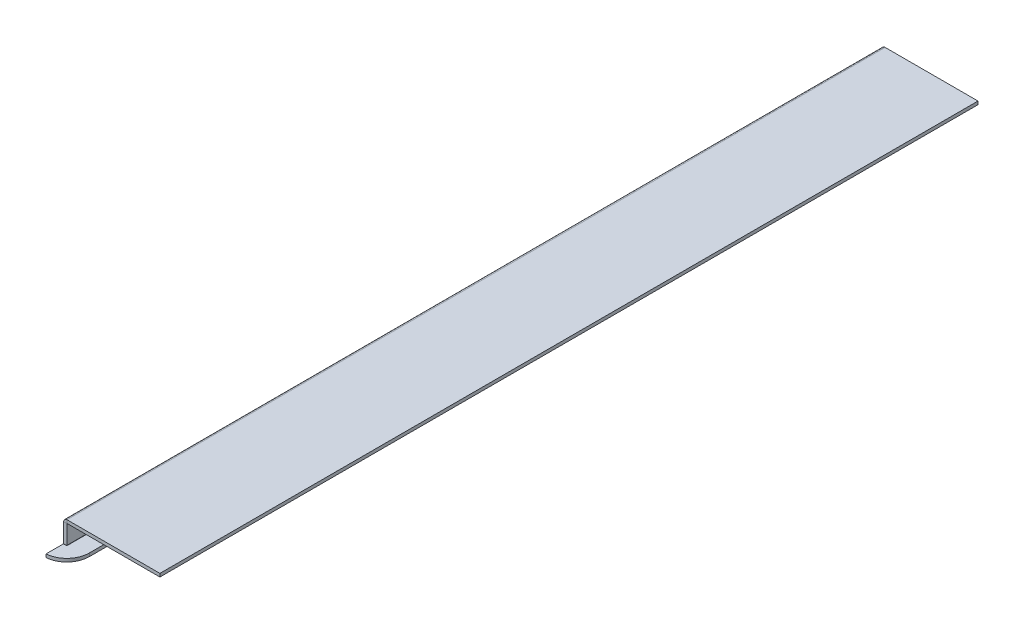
ISO-10303-21;
HEADER;
FILE_DESCRIPTION(('STEP AP214'),'2;1');
FILE_NAME('part.step','',(''),(''),'','','');
FILE_SCHEMA(('AUTOMOTIVE_DESIGN { 1 0 10303 214 1 1 1 1 }'));
ENDSEC;
DATA;
#1=APPLICATION_CONTEXT('core data for automotive mechanical design processes');
#2=APPLICATION_PROTOCOL_DEFINITION('international standard','automotive_design',2000,#1);
#3=PRODUCT_CONTEXT('',#1,'mechanical');
#4=PRODUCT('Part','Part','',(#3));
#5=PRODUCT_RELATED_PRODUCT_CATEGORY('part','',(#4));
#6=PRODUCT_DEFINITION_FORMATION('','',#4);
#7=PRODUCT_DEFINITION_CONTEXT('part definition',#1,'design');
#8=PRODUCT_DEFINITION('design','',#6,#7);
#9=PRODUCT_DEFINITION_SHAPE('','',#8);
#10=(LENGTH_UNIT() NAMED_UNIT(*) SI_UNIT(.MILLI.,.METRE.));
#11=(NAMED_UNIT(*) PLANE_ANGLE_UNIT() SI_UNIT($,.RADIAN.));
#12=(NAMED_UNIT(*) SI_UNIT($,.STERADIAN.) SOLID_ANGLE_UNIT());
#13=UNCERTAINTY_MEASURE_WITH_UNIT(LENGTH_MEASURE(1.E-05),#10,'distance_accuracy_value','');
#14=(GEOMETRIC_REPRESENTATION_CONTEXT(3) GLOBAL_UNCERTAINTY_ASSIGNED_CONTEXT((#13)) GLOBAL_UNIT_ASSIGNED_CONTEXT((#10,
#11,#12)) REPRESENTATION_CONTEXT('',''));
#15=CARTESIAN_POINT('',(0.,0.,0.));
#16=DIRECTION('',(0.,0.,1.));
#17=DIRECTION('',(1.,0.,0.));
#18=AXIS2_PLACEMENT_3D('',#15,#16,#17);
#19=CARTESIAN_POINT('',(0.,0.,255.));
#20=DIRECTION('',(0.,1.,0.));
#21=DIRECTION('',(-1.,0.,0.));
#22=AXIS2_PLACEMENT_3D('',#19,#20,#21);
#23=PLANE('',#22);
#24=CARTESIAN_POINT('',(-0.999999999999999,0.,-252.035759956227));
#25=DIRECTION('',(0.,1.,0.));
#26=DIRECTION('',(-1.,0.,0.));
#27=AXIS2_PLACEMENT_3D('',#24,#25,#26);
#28=CIRCLE('',#27,14.);
#29=CARTESIAN_POINT('',(-7.33198224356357E-11,0.,-266.000000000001));
#30=VERTEX_POINT('',#29);
#31=CARTESIAN_POINT('',(13.,0.,-252.035759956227));
#32=VERTEX_POINT('',#31);
#33=EDGE_CURVE('E323',#30,#32,#28,.F.);
#34=ORIENTED_EDGE('',*,*,#33,.T.);
#35=DIRECTION('',(0.,0.,-1.));
#36=VECTOR('',#35,1.);
#37=CARTESIAN_POINT('',(13.,0.,255.));
#38=LINE('',#37,#36);
#39=CARTESIAN_POINT('',(13.,0.,252.035759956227));
#40=VERTEX_POINT('',#39);
#41=EDGE_CURVE('E209',#40,#32,#38,.T.);
#42=ORIENTED_EDGE('',*,*,#41,.F.);
#43=CARTESIAN_POINT('',(-0.999999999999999,0.,252.035759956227));
#44=DIRECTION('',(0.,1.,0.));
#45=DIRECTION('',(-1.,0.,0.));
#46=AXIS2_PLACEMENT_3D('',#43,#44,#45);
#47=CIRCLE('',#46,14.);
#48=CARTESIAN_POINT('',(-7.33198224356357E-11,0.,266.000000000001));
#49=VERTEX_POINT('',#48);
#50=EDGE_CURVE('E319',#49,#40,#47,.T.);
#51=ORIENTED_EDGE('',*,*,#50,.F.);
#52=DIRECTION('',(0.,0.,-1.));
#53=VECTOR('',#52,1.);
#54=CARTESIAN_POINT('',(-7.33193887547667E-11,0.,255.1));
#55=LINE('',#54,#53);
#56=CARTESIAN_POINT('',(-7.33193887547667E-11,0.,255.1));
#57=VERTEX_POINT('',#56);
#58=EDGE_CURVE('E373',#49,#57,#55,.T.);
#59=ORIENTED_EDGE('',*,*,#58,.T.);
#60=DIRECTION('',(1.,0.,0.));
#61=VECTOR('',#60,1.);
#62=CARTESIAN_POINT('',(2.1,0.,255.1));
#63=LINE('',#62,#61);
#64=CARTESIAN_POINT('',(2.1,0.,255.1));
#65=VERTEX_POINT('',#64);
#66=EDGE_CURVE('E363',#57,#65,#63,.T.);
#67=ORIENTED_EDGE('',*,*,#66,.T.);
#68=DIRECTION('',(0.,0.,-1.));
#69=VECTOR('',#68,1.);
#70=CARTESIAN_POINT('',(2.1,0.,255.));
#71=LINE('',#70,#69);
#72=CARTESIAN_POINT('',(2.1,0.,255.));
#73=VERTEX_POINT('',#72);
#74=EDGE_CURVE('E372',#65,#73,#71,.T.);
#75=ORIENTED_EDGE('',*,*,#74,.T.);
#76=DIRECTION('',(0.,0.,-1.));
#77=VECTOR('',#76,1.);
#78=CARTESIAN_POINT('',(2.1,0.,255.));
#79=LINE('',#78,#77);
#80=CARTESIAN_POINT('',(2.1,0.,-255.));
#81=VERTEX_POINT('',#80);
#82=EDGE_CURVE('E160',#73,#81,#79,.T.);
#83=ORIENTED_EDGE('',*,*,#82,.T.);
#84=DIRECTION('',(0.,0.,1.));
#85=VECTOR('',#84,1.);
#86=CARTESIAN_POINT('',(2.1,0.,-255.));
#87=LINE('',#86,#85);
#88=CARTESIAN_POINT('',(2.1,0.,-255.1));
#89=VERTEX_POINT('',#88);
#90=EDGE_CURVE('E417',#89,#81,#87,.T.);
#91=ORIENTED_EDGE('',*,*,#90,.F.);
#92=DIRECTION('',(1.,0.,0.));
#93=VECTOR('',#92,1.);
#94=CARTESIAN_POINT('',(2.1,0.,-255.1));
#95=LINE('',#94,#93);
#96=CARTESIAN_POINT('',(-7.33193887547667E-11,0.,-255.1));
#97=VERTEX_POINT('',#96);
#98=EDGE_CURVE('E418',#97,#89,#95,.T.);
#99=ORIENTED_EDGE('',*,*,#98,.F.);
#100=DIRECTION('',(0.,0.,1.));
#101=VECTOR('',#100,1.);
#102=CARTESIAN_POINT('',(-7.33193887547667E-11,0.,-255.1));
#103=LINE('',#102,#101);
#104=EDGE_CURVE('E399',#30,#97,#103,.T.);
#105=ORIENTED_EDGE('',*,*,#104,.F.);
#106=EDGE_LOOP('',(#34,#42,#51,#59,#67,#75,#83,#91,#99,#105));
#107=FACE_BOUND('',#106,.T.);
#108=ADVANCED_FACE('F36',(#107),#23,.F.);
#109=CARTESIAN_POINT('',(0.,2.,255.));
#110=DIRECTION('',(0.,1.,0.));
#111=DIRECTION('',(-1.,0.,0.));
#112=AXIS2_PLACEMENT_3D('',#109,#110,#111);
#113=PLANE('',#112);
#114=DIRECTION('',(0.,0.,-1.));
#115=VECTOR('',#114,1.);
#116=CARTESIAN_POINT('',(13.,2.,255.));
#117=LINE('',#116,#115);
#118=CARTESIAN_POINT('',(13.,2.,252.035759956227));
#119=VERTEX_POINT('',#118);
#120=CARTESIAN_POINT('',(13.,2.,-252.035759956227));
#121=VERTEX_POINT('',#120);
#122=EDGE_CURVE('E206',#119,#121,#117,.T.);
#123=ORIENTED_EDGE('',*,*,#122,.T.);
#124=CARTESIAN_POINT('',(-0.999999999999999,2.,-252.035759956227));
#125=DIRECTION('',(0.,1.,0.));
#126=DIRECTION('',(-1.,0.,0.));
#127=AXIS2_PLACEMENT_3D('',#124,#125,#126);
#128=CIRCLE('',#127,14.);
#129=CARTESIAN_POINT('',(-7.33199449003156E-11,2.,-266.000000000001));
#130=VERTEX_POINT('',#129);
#131=EDGE_CURVE('E429',#130,#121,#128,.F.);
#132=ORIENTED_EDGE('',*,*,#131,.F.);
#133=DIRECTION('',(0.,0.,1.));
#134=VECTOR('',#133,1.);
#135=CARTESIAN_POINT('',(-7.33195112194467E-11,2.,-255.1));
#136=LINE('',#135,#134);
#137=CARTESIAN_POINT('',(-7.33195112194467E-11,2.,-255.1));
#138=VERTEX_POINT('',#137);
#139=EDGE_CURVE('E403',#130,#138,#136,.T.);
#140=ORIENTED_EDGE('',*,*,#139,.T.);
#141=DIRECTION('',(1.,0.,0.));
#142=VECTOR('',#141,1.);
#143=CARTESIAN_POINT('',(2.1,2.,-255.1));
#144=LINE('',#143,#142);
#145=CARTESIAN_POINT('',(2.1,2.,-255.1));
#146=VERTEX_POINT('',#145);
#147=EDGE_CURVE('E409',#138,#146,#144,.T.);
#148=ORIENTED_EDGE('',*,*,#147,.T.);
#149=DIRECTION('',(0.,0.,1.));
#150=VECTOR('',#149,1.);
#151=CARTESIAN_POINT('',(2.1,2.,-255.));
#152=LINE('',#151,#150);
#153=CARTESIAN_POINT('',(2.1,2.,-255.));
#154=VERTEX_POINT('',#153);
#155=EDGE_CURVE('E413',#146,#154,#152,.T.);
#156=ORIENTED_EDGE('',*,*,#155,.T.);
#157=DIRECTION('',(0.,0.,-1.));
#158=VECTOR('',#157,1.);
#159=CARTESIAN_POINT('',(2.1,2.,255.));
#160=LINE('',#159,#158);
#161=CARTESIAN_POINT('',(2.1,2.,255.));
#162=VERTEX_POINT('',#161);
#163=EDGE_CURVE('E204',#162,#154,#160,.T.);
#164=ORIENTED_EDGE('',*,*,#163,.F.);
#165=DIRECTION('',(0.,0.,-1.));
#166=VECTOR('',#165,1.);
#167=CARTESIAN_POINT('',(2.1,2.,255.));
#168=LINE('',#167,#166);
#169=CARTESIAN_POINT('',(2.1,2.,255.1));
#170=VERTEX_POINT('',#169);
#171=EDGE_CURVE('E383',#170,#162,#168,.T.);
#172=ORIENTED_EDGE('',*,*,#171,.F.);
#173=DIRECTION('',(1.,0.,0.));
#174=VECTOR('',#173,1.);
#175=CARTESIAN_POINT('',(2.1,2.,255.1));
#176=LINE('',#175,#174);
#177=CARTESIAN_POINT('',(-7.33195112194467E-11,2.,255.1));
#178=VERTEX_POINT('',#177);
#179=EDGE_CURVE('E365',#178,#170,#176,.T.);
#180=ORIENTED_EDGE('',*,*,#179,.F.);
#181=DIRECTION('',(0.,0.,-1.));
#182=VECTOR('',#181,1.);
#183=CARTESIAN_POINT('',(-7.33195112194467E-11,2.,255.1));
#184=LINE('',#183,#182);
#185=CARTESIAN_POINT('',(-7.33199449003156E-11,2.,266.000000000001));
#186=VERTEX_POINT('',#185);
#187=EDGE_CURVE('E376',#186,#178,#184,.T.);
#188=ORIENTED_EDGE('',*,*,#187,.F.);
#189=CARTESIAN_POINT('',(-0.999999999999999,2.,252.035759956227));
#190=DIRECTION('',(0.,1.,0.));
#191=DIRECTION('',(-1.,0.,0.));
#192=AXIS2_PLACEMENT_3D('',#189,#190,#191);
#193=CIRCLE('',#192,14.);
#194=EDGE_CURVE('E424',#186,#119,#193,.T.);
#195=ORIENTED_EDGE('',*,*,#194,.T.);
#196=EDGE_LOOP('',(#123,#132,#140,#148,#156,#164,#172,#180,#188,#195));
#197=FACE_BOUND('',#196,.T.);
#198=ADVANCED_FACE('F267',(#197),#113,.T.);
#199=CARTESIAN_POINT('',(13.,2.,255.));
#200=DIRECTION('',(1.,0.,0.));
#201=DIRECTION('',(0.,0.,-1.));
#202=AXIS2_PLACEMENT_3D('',#199,#200,#201);
#203=PLANE('',#202);
#204=ORIENTED_EDGE('',*,*,#41,.T.);
#205=DIRECTION('',(0.,1.,0.));
#206=VECTOR('',#205,1.);
#207=CARTESIAN_POINT('',(13.,2.,-252.035759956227));
#208=LINE('',#207,#206);
#209=EDGE_CURVE('E308',#121,#32,#208,.F.);
#210=ORIENTED_EDGE('',*,*,#209,.F.);
#211=ORIENTED_EDGE('',*,*,#122,.F.);
#212=DIRECTION('',(0.,1.,0.));
#213=VECTOR('',#212,1.);
#214=CARTESIAN_POINT('',(13.,2.,252.035759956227));
#215=LINE('',#214,#213);
#216=EDGE_CURVE('E311',#119,#40,#215,.F.);
#217=ORIENTED_EDGE('',*,*,#216,.T.);
#218=EDGE_LOOP('',(#204,#210,#211,#217));
#219=FACE_BOUND('',#218,.T.);
#220=ADVANCED_FACE('F273',(#219),#203,.T.);
#221=CARTESIAN_POINT('',(2.1,16.,255.));
#222=DIRECTION('',(0.,0.,1.));
#223=DIRECTION('',(1.,0.,0.));
#224=AXIS2_PLACEMENT_3D('',#221,#222,#223);
#225=PLANE('',#224);
#226=DIRECTION('',(0.,-1.,0.));
#227=VECTOR('',#226,1.);
#228=CARTESIAN_POINT('',(2.1,16.,255.));
#229=LINE('',#228,#227);
#230=CARTESIAN_POINT('',(2.1,16.,255.));
#231=VERTEX_POINT('',#230);
#232=CARTESIAN_POINT('',(2.1,14.,255.));
#233=VERTEX_POINT('',#232);
#234=EDGE_CURVE('E11',#231,#233,#229,.T.);
#235=ORIENTED_EDGE('',*,*,#234,.F.);
#236=CARTESIAN_POINT('',(2.1,13.9,255.));
#237=DIRECTION('',(0.,0.,-1.));
#238=DIRECTION('',(-1.,0.,0.));
#239=AXIS2_PLACEMENT_3D('',#236,#237,#238);
#240=CIRCLE('',#239,2.1);
#241=CARTESIAN_POINT('',(0.,13.9,255.));
#242=VERTEX_POINT('',#241);
#243=EDGE_CURVE('E140',#231,#242,#240,.F.);
#244=ORIENTED_EDGE('',*,*,#243,.T.);
#245=DIRECTION('',(-1.,0.,0.));
#246=VECTOR('',#245,1.);
#247=CARTESIAN_POINT('',(2.,13.9,255.));
#248=LINE('',#247,#246);
#249=CARTESIAN_POINT('',(2.,13.9,255.));
#250=VERTEX_POINT('',#249);
#251=EDGE_CURVE('E45',#250,#242,#248,.T.);
#252=ORIENTED_EDGE('',*,*,#251,.F.);
#253=CARTESIAN_POINT('',(2.1,13.9,255.));
#254=DIRECTION('',(0.,0.,1.));
#255=DIRECTION('',(1.,0.,0.));
#256=AXIS2_PLACEMENT_3D('',#253,#254,#255);
#257=CIRCLE('',#256,0.0999999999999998);
#258=EDGE_CURVE('E226',#233,#250,#257,.T.);
#259=ORIENTED_EDGE('',*,*,#258,.F.);
#260=EDGE_LOOP('',(#235,#244,#252,#259));
#261=FACE_BOUND('',#260,.T.);
#262=ADVANCED_FACE('F38',(#261),#225,.T.);
#263=CARTESIAN_POINT('',(2.,13.9,255.));
#264=DIRECTION('',(0.,0.,1.));
#265=DIRECTION('',(1.,0.,0.));
#266=AXIS2_PLACEMENT_3D('',#263,#264,#265);
#267=PLANE('',#266);
#268=DIRECTION('',(-1.,0.,0.));
#269=VECTOR('',#268,1.);
#270=CARTESIAN_POINT('',(0.,16.,255.));
#271=LINE('',#270,#269);
#272=CARTESIAN_POINT('',(60.,16.,255.));
#273=VERTEX_POINT('',#272);
#274=EDGE_CURVE('E145',#273,#231,#271,.T.);
#275=ORIENTED_EDGE('',*,*,#274,.T.);
#276=ORIENTED_EDGE('',*,*,#234,.T.);
#277=DIRECTION('',(-1.,0.,0.));
#278=VECTOR('',#277,1.);
#279=CARTESIAN_POINT('',(0.,14.,255.));
#280=LINE('',#279,#278);
#281=CARTESIAN_POINT('',(60.,14.,255.));
#282=VERTEX_POINT('',#281);
#283=EDGE_CURVE('E239',#282,#233,#280,.T.);
#284=ORIENTED_EDGE('',*,*,#283,.F.);
#285=DIRECTION('',(0.,-1.,0.));
#286=VECTOR('',#285,1.);
#287=CARTESIAN_POINT('',(60.,16.,255.));
#288=LINE('',#287,#286);
#289=EDGE_CURVE('E241',#273,#282,#288,.T.);
#290=ORIENTED_EDGE('',*,*,#289,.F.);
#291=EDGE_LOOP('',(#275,#276,#284,#290));
#292=FACE_BOUND('',#291,.T.);
#293=ADVANCED_FACE('F251',(#292),#267,.T.);
#294=CARTESIAN_POINT('',(0.,13.9,-255.));
#295=DIRECTION('',(0.,0.,-1.));
#296=DIRECTION('',(-1.,0.,0.));
#297=AXIS2_PLACEMENT_3D('',#294,#295,#296);
#298=PLANE('',#297);
#299=DIRECTION('',(1.,0.,0.));
#300=VECTOR('',#299,1.);
#301=CARTESIAN_POINT('',(0.,13.9,-255.));
#302=LINE('',#301,#300);
#303=CARTESIAN_POINT('',(0.,13.9,-255.));
#304=VERTEX_POINT('',#303);
#305=CARTESIAN_POINT('',(2.,13.9,-255.));
#306=VERTEX_POINT('',#305);
#307=EDGE_CURVE('E138',#304,#306,#302,.T.);
#308=ORIENTED_EDGE('',*,*,#307,.F.);
#309=CARTESIAN_POINT('',(2.1,13.9,-255.));
#310=DIRECTION('',(0.,0.,-1.));
#311=DIRECTION('',(-1.,0.,0.));
#312=AXIS2_PLACEMENT_3D('',#309,#310,#311);
#313=CIRCLE('',#312,2.1);
#314=CARTESIAN_POINT('',(2.1,16.,-255.));
#315=VERTEX_POINT('',#314);
#316=EDGE_CURVE('E152',#315,#304,#313,.F.);
#317=ORIENTED_EDGE('',*,*,#316,.F.);
#318=DIRECTION('',(0.,1.,0.));
#319=VECTOR('',#318,1.);
#320=CARTESIAN_POINT('',(2.1,14.,-255.));
#321=LINE('',#320,#319);
#322=CARTESIAN_POINT('',(2.1,14.,-255.));
#323=VERTEX_POINT('',#322);
#324=EDGE_CURVE('E217',#323,#315,#321,.T.);
#325=ORIENTED_EDGE('',*,*,#324,.F.);
#326=CARTESIAN_POINT('',(2.1,13.9,-255.));
#327=DIRECTION('',(0.,0.,1.));
#328=DIRECTION('',(1.,0.,0.));
#329=AXIS2_PLACEMENT_3D('',#326,#327,#328);
#330=CIRCLE('',#329,0.0999999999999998);
#331=EDGE_CURVE('E169',#323,#306,#330,.T.);
#332=ORIENTED_EDGE('',*,*,#331,.T.);
#333=EDGE_LOOP('',(#308,#317,#325,#332));
#334=FACE_BOUND('',#333,.T.);
#335=ADVANCED_FACE('F231',(#334),#298,.T.);
#336=CARTESIAN_POINT('',(2.1,14.,-255.));
#337=DIRECTION('',(0.,0.,-1.));
#338=DIRECTION('',(-1.,0.,0.));
#339=AXIS2_PLACEMENT_3D('',#336,#337,#338);
#340=PLANE('',#339);
#341=DIRECTION('',(0.,-1.,0.));
#342=VECTOR('',#341,1.);
#343=CARTESIAN_POINT('',(0.,0.,-255.));
#344=LINE('',#343,#342);
#345=CARTESIAN_POINT('',(0.,2.1,-255.));
#346=VERTEX_POINT('',#345);
#347=EDGE_CURVE('E182',#304,#346,#344,.T.);
#348=ORIENTED_EDGE('',*,*,#347,.F.);
#349=ORIENTED_EDGE('',*,*,#307,.T.);
#350=DIRECTION('',(0.,1.,0.));
#351=VECTOR('',#350,1.);
#352=CARTESIAN_POINT('',(2.,0.,-255.));
#353=LINE('',#352,#351);
#354=CARTESIAN_POINT('',(2.,2.1,-255.));
#355=VERTEX_POINT('',#354);
#356=EDGE_CURVE('E166',#306,#355,#353,.F.);
#357=ORIENTED_EDGE('',*,*,#356,.T.);
#358=DIRECTION('',(-1.,0.,0.));
#359=VECTOR('',#358,1.);
#360=CARTESIAN_POINT('',(2.,2.1,-255.));
#361=LINE('',#360,#359);
#362=EDGE_CURVE('E88',#355,#346,#361,.T.);
#363=ORIENTED_EDGE('',*,*,#362,.T.);
#364=EDGE_LOOP('',(#348,#349,#357,#363));
#365=FACE_BOUND('',#364,.T.);
#366=ADVANCED_FACE('F219',(#365),#340,.T.);
#367=CARTESIAN_POINT('',(0.,2.1,255.));
#368=DIRECTION('',(0.,0.,1.));
#369=DIRECTION('',(1.,0.,0.));
#370=AXIS2_PLACEMENT_3D('',#367,#368,#369);
#371=PLANE('',#370);
#372=DIRECTION('',(1.,0.,0.));
#373=VECTOR('',#372,1.);
#374=CARTESIAN_POINT('',(0.,2.1,255.));
#375=LINE('',#374,#373);
#376=CARTESIAN_POINT('',(0.,2.1,255.));
#377=VERTEX_POINT('',#376);
#378=CARTESIAN_POINT('',(2.,2.1,255.));
#379=VERTEX_POINT('',#378);
#380=EDGE_CURVE('E215',#377,#379,#375,.T.);
#381=ORIENTED_EDGE('',*,*,#380,.F.);
#382=CARTESIAN_POINT('',(2.1,2.1,255.));
#383=DIRECTION('',(0.,0.,-1.));
#384=DIRECTION('',(-1.,0.,0.));
#385=AXIS2_PLACEMENT_3D('',#382,#383,#384);
#386=CIRCLE('',#385,2.1);
#387=EDGE_CURVE('E53',#377,#73,#386,.F.);
#388=ORIENTED_EDGE('',*,*,#387,.T.);
#389=DIRECTION('',(0.,-1.,0.));
#390=VECTOR('',#389,1.);
#391=CARTESIAN_POINT('',(2.1,2.,255.));
#392=LINE('',#391,#390);
#393=EDGE_CURVE('E102',#162,#73,#392,.T.);
#394=ORIENTED_EDGE('',*,*,#393,.F.);
#395=CARTESIAN_POINT('',(2.1,2.1,255.));
#396=DIRECTION('',(0.,0.,1.));
#397=DIRECTION('',(1.,0.,0.));
#398=AXIS2_PLACEMENT_3D('',#395,#396,#397);
#399=CIRCLE('',#398,0.0999999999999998);
#400=EDGE_CURVE('E186',#379,#162,#399,.T.);
#401=ORIENTED_EDGE('',*,*,#400,.F.);
#402=EDGE_LOOP('',(#381,#388,#394,#401));
#403=FACE_BOUND('',#402,.T.);
#404=ADVANCED_FACE('F285',(#403),#371,.T.);
#405=CARTESIAN_POINT('',(2.1,2.,255.));
#406=DIRECTION('',(0.,0.,1.));
#407=DIRECTION('',(1.,0.,0.));
#408=AXIS2_PLACEMENT_3D('',#405,#406,#407);
#409=PLANE('',#408);
#410=DIRECTION('',(0.,-1.,0.));
#411=VECTOR('',#410,1.);
#412=CARTESIAN_POINT('',(0.,0.,255.));
#413=LINE('',#412,#411);
#414=EDGE_CURVE('E130',#242,#377,#413,.T.);
#415=ORIENTED_EDGE('',*,*,#414,.T.);
#416=ORIENTED_EDGE('',*,*,#380,.T.);
#417=DIRECTION('',(0.,1.,0.));
#418=VECTOR('',#417,1.);
#419=CARTESIAN_POINT('',(2.,0.,255.));
#420=LINE('',#419,#418);
#421=EDGE_CURVE('E133',#250,#379,#420,.F.);
#422=ORIENTED_EDGE('',*,*,#421,.F.);
#423=ORIENTED_EDGE('',*,*,#251,.T.);
#424=EDGE_LOOP('',(#415,#416,#422,#423));
#425=FACE_BOUND('',#424,.T.);
#426=ADVANCED_FACE('F128',(#425),#409,.T.);
#427=CARTESIAN_POINT('',(2.1,0.,-255.));
#428=DIRECTION('',(0.,0.,-1.));
#429=DIRECTION('',(-1.,0.,0.));
#430=AXIS2_PLACEMENT_3D('',#427,#428,#429);
#431=PLANE('',#430);
#432=DIRECTION('',(0.,1.,0.));
#433=VECTOR('',#432,1.);
#434=CARTESIAN_POINT('',(2.1,0.,-255.));
#435=LINE('',#434,#433);
#436=EDGE_CURVE('E96',#81,#154,#435,.T.);
#437=ORIENTED_EDGE('',*,*,#436,.F.);
#438=CARTESIAN_POINT('',(2.1,2.1,-255.));
#439=DIRECTION('',(0.,0.,-1.));
#440=DIRECTION('',(-1.,0.,0.));
#441=AXIS2_PLACEMENT_3D('',#438,#439,#440);
#442=CIRCLE('',#441,2.1);
#443=EDGE_CURVE('E184',#346,#81,#442,.F.);
#444=ORIENTED_EDGE('',*,*,#443,.F.);
#445=ORIENTED_EDGE('',*,*,#362,.F.);
#446=CARTESIAN_POINT('',(2.1,2.1,-255.));
#447=DIRECTION('',(0.,0.,1.));
#448=DIRECTION('',(1.,0.,0.));
#449=AXIS2_PLACEMENT_3D('',#446,#447,#448);
#450=CIRCLE('',#449,0.0999999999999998);
#451=EDGE_CURVE('E164',#355,#154,#450,.T.);
#452=ORIENTED_EDGE('',*,*,#451,.T.);
#453=EDGE_LOOP('',(#437,#444,#445,#452));
#454=FACE_BOUND('',#453,.T.);
#455=ADVANCED_FACE('F279',(#454),#431,.T.);
#456=CARTESIAN_POINT('',(2.1,2.1,255.));
#457=DIRECTION('',(0.,0.,-1.));
#458=DIRECTION('',(-1.,0.,0.));
#459=AXIS2_PLACEMENT_3D('',#456,#457,#458);
#460=CYLINDRICAL_SURFACE('',#459,0.0999999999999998);
#461=ORIENTED_EDGE('',*,*,#451,.F.);
#462=DIRECTION('',(0.,0.,-1.));
#463=VECTOR('',#462,1.);
#464=CARTESIAN_POINT('',(2.,2.1,255.));
#465=LINE('',#464,#463);
#466=EDGE_CURVE('E201',#379,#355,#465,.T.);
#467=ORIENTED_EDGE('',*,*,#466,.F.);
#468=ORIENTED_EDGE('',*,*,#400,.T.);
#469=ORIENTED_EDGE('',*,*,#163,.T.);
#470=EDGE_LOOP('',(#461,#467,#468,#469));
#471=FACE_BOUND('',#470,.T.);
#472=ADVANCED_FACE('F282',(#471),#460,.F.);
#473=CARTESIAN_POINT('',(2.,0.,255.));
#474=DIRECTION('',(1.,0.,0.));
#475=DIRECTION('',(0.,0.,-1.));
#476=AXIS2_PLACEMENT_3D('',#473,#474,#475);
#477=PLANE('',#476);
#478=ORIENTED_EDGE('',*,*,#356,.F.);
#479=DIRECTION('',(0.,0.,-1.));
#480=VECTOR('',#479,1.);
#481=CARTESIAN_POINT('',(2.,13.9,255.));
#482=LINE('',#481,#480);
#483=EDGE_CURVE('E198',#250,#306,#482,.T.);
#484=ORIENTED_EDGE('',*,*,#483,.F.);
#485=ORIENTED_EDGE('',*,*,#421,.T.);
#486=ORIENTED_EDGE('',*,*,#466,.T.);
#487=EDGE_LOOP('',(#478,#484,#485,#486));
#488=FACE_BOUND('',#487,.T.);
#489=ADVANCED_FACE('F228',(#488),#477,.T.);
#490=CARTESIAN_POINT('',(2.1,13.9,255.));
#491=DIRECTION('',(0.,0.,-1.));
#492=DIRECTION('',(-1.,0.,0.));
#493=AXIS2_PLACEMENT_3D('',#490,#491,#492);
#494=CYLINDRICAL_SURFACE('',#493,0.0999999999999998);
#495=ORIENTED_EDGE('',*,*,#331,.F.);
#496=DIRECTION('',(0.,0.,-1.));
#497=VECTOR('',#496,1.);
#498=CARTESIAN_POINT('',(2.1,14.,255.));
#499=LINE('',#498,#497);
#500=EDGE_CURVE('E195',#233,#323,#499,.T.);
#501=ORIENTED_EDGE('',*,*,#500,.F.);
#502=ORIENTED_EDGE('',*,*,#258,.T.);
#503=ORIENTED_EDGE('',*,*,#483,.T.);
#504=EDGE_LOOP('',(#495,#501,#502,#503));
#505=FACE_BOUND('',#504,.T.);
#506=ADVANCED_FACE('F224',(#505),#494,.F.);
#507=CARTESIAN_POINT('',(0.,14.,255.));
#508=DIRECTION('',(0.,-1.,0.));
#509=DIRECTION('',(1.,0.,0.));
#510=AXIS2_PLACEMENT_3D('',#507,#508,#509);
#511=PLANE('',#510);
#512=DIRECTION('',(-1.,0.,0.));
#513=VECTOR('',#512,1.);
#514=CARTESIAN_POINT('',(0.,14.,-255.));
#515=LINE('',#514,#513);
#516=CARTESIAN_POINT('',(60.,14.,-255.));
#517=VERTEX_POINT('',#516);
#518=EDGE_CURVE('E172',#517,#323,#515,.T.);
#519=ORIENTED_EDGE('',*,*,#518,.F.);
#520=DIRECTION('',(0.,0.,-1.));
#521=VECTOR('',#520,1.);
#522=CARTESIAN_POINT('',(60.,14.,255.));
#523=LINE('',#522,#521);
#524=EDGE_CURVE('E193',#282,#517,#523,.T.);
#525=ORIENTED_EDGE('',*,*,#524,.F.);
#526=ORIENTED_EDGE('',*,*,#283,.T.);
#527=ORIENTED_EDGE('',*,*,#500,.T.);
#528=EDGE_LOOP('',(#519,#525,#526,#527));
#529=FACE_BOUND('',#528,.T.);
#530=ADVANCED_FACE('F237',(#529),#511,.T.);
#531=CARTESIAN_POINT('',(60.,16.,255.));
#532=DIRECTION('',(1.,0.,0.));
#533=DIRECTION('',(0.,0.,-1.));
#534=AXIS2_PLACEMENT_3D('',#531,#532,#533);
#535=PLANE('',#534);
#536=DIRECTION('',(0.,-1.,0.));
#537=VECTOR('',#536,1.);
#538=CARTESIAN_POINT('',(60.,16.,-255.));
#539=LINE('',#538,#537);
#540=CARTESIAN_POINT('',(60.,16.,-255.));
#541=VERTEX_POINT('',#540);
#542=EDGE_CURVE('E175',#541,#517,#539,.T.);
#543=ORIENTED_EDGE('',*,*,#542,.F.);
#544=DIRECTION('',(0.,0.,-1.));
#545=VECTOR('',#544,1.);
#546=CARTESIAN_POINT('',(60.,16.,255.));
#547=LINE('',#546,#545);
#548=EDGE_CURVE('E191',#273,#541,#547,.T.);
#549=ORIENTED_EDGE('',*,*,#548,.F.);
#550=ORIENTED_EDGE('',*,*,#289,.T.);
#551=ORIENTED_EDGE('',*,*,#524,.T.);
#552=EDGE_LOOP('',(#543,#549,#550,#551));
#553=FACE_BOUND('',#552,.T.);
#554=ADVANCED_FACE('F257',(#553),#535,.T.);
#555=CARTESIAN_POINT('',(0.,16.,255.));
#556=DIRECTION('',(0.,-1.,0.));
#557=DIRECTION('',(1.,0.,0.));
#558=AXIS2_PLACEMENT_3D('',#555,#556,#557);
#559=PLANE('',#558);
#560=DIRECTION('',(-1.,0.,0.));
#561=VECTOR('',#560,1.);
#562=CARTESIAN_POINT('',(0.,16.,-255.));
#563=LINE('',#562,#561);
#564=EDGE_CURVE('E178',#541,#315,#563,.T.);
#565=ORIENTED_EDGE('',*,*,#564,.T.);
#566=DIRECTION('',(0.,0.,-1.));
#567=VECTOR('',#566,1.);
#568=CARTESIAN_POINT('',(2.1,16.,255.));
#569=LINE('',#568,#567);
#570=EDGE_CURVE('E154',#231,#315,#569,.T.);
#571=ORIENTED_EDGE('',*,*,#570,.F.);
#572=ORIENTED_EDGE('',*,*,#274,.F.);
#573=ORIENTED_EDGE('',*,*,#548,.T.);
#574=EDGE_LOOP('',(#565,#571,#572,#573));
#575=FACE_BOUND('',#574,.T.);
#576=ADVANCED_FACE('F253',(#575),#559,.F.);
#577=CARTESIAN_POINT('',(2.1,13.9,255.));
#578=DIRECTION('',(0.,0.,-1.));
#579=DIRECTION('',(-1.,0.,0.));
#580=AXIS2_PLACEMENT_3D('',#577,#578,#579);
#581=CYLINDRICAL_SURFACE('',#580,2.1);
#582=ORIENTED_EDGE('',*,*,#316,.T.);
#583=DIRECTION('',(0.,0.,-1.));
#584=VECTOR('',#583,1.);
#585=CARTESIAN_POINT('',(0.,13.9,255.));
#586=LINE('',#585,#584);
#587=EDGE_CURVE('E149',#242,#304,#586,.T.);
#588=ORIENTED_EDGE('',*,*,#587,.F.);
#589=ORIENTED_EDGE('',*,*,#243,.F.);
#590=ORIENTED_EDGE('',*,*,#570,.T.);
#591=EDGE_LOOP('',(#582,#588,#589,#590));
#592=FACE_BOUND('',#591,.T.);
#593=ADVANCED_FACE('F150',(#592),#581,.T.);
#594=CARTESIAN_POINT('',(0.,0.,255.));
#595=DIRECTION('',(1.,0.,0.));
#596=DIRECTION('',(0.,0.,-1.));
#597=AXIS2_PLACEMENT_3D('',#594,#595,#596);
#598=PLANE('',#597);
#599=ORIENTED_EDGE('',*,*,#347,.T.);
#600=DIRECTION('',(0.,0.,-1.));
#601=VECTOR('',#600,1.);
#602=CARTESIAN_POINT('',(0.,2.1,255.));
#603=LINE('',#602,#601);
#604=EDGE_CURVE('E155',#377,#346,#603,.T.);
#605=ORIENTED_EDGE('',*,*,#604,.F.);
#606=ORIENTED_EDGE('',*,*,#414,.F.);
#607=ORIENTED_EDGE('',*,*,#587,.T.);
#608=EDGE_LOOP('',(#599,#605,#606,#607));
#609=FACE_BOUND('',#608,.T.);
#610=ADVANCED_FACE('F157',(#609),#598,.F.);
#611=CARTESIAN_POINT('',(2.1,2.1,255.));
#612=DIRECTION('',(0.,0.,-1.));
#613=DIRECTION('',(-1.,0.,0.));
#614=AXIS2_PLACEMENT_3D('',#611,#612,#613);
#615=CYLINDRICAL_SURFACE('',#614,2.1);
#616=ORIENTED_EDGE('',*,*,#443,.T.);
#617=ORIENTED_EDGE('',*,*,#82,.F.);
#618=ORIENTED_EDGE('',*,*,#387,.F.);
#619=ORIENTED_EDGE('',*,*,#604,.T.);
#620=EDGE_LOOP('',(#616,#617,#618,#619));
#621=FACE_BOUND('',#620,.T.);
#622=ADVANCED_FACE('F440',(#621),#615,.T.);
#623=CARTESIAN_POINT('',(2.1,2.1,-255.));
#624=DIRECTION('',(0.,0.,1.));
#625=DIRECTION('',(1.,0.,0.));
#626=AXIS2_PLACEMENT_3D('',#623,#624,#625);
#627=PLANE('',#626);
#628=ORIENTED_EDGE('',*,*,#518,.T.);
#629=ORIENTED_EDGE('',*,*,#324,.T.);
#630=ORIENTED_EDGE('',*,*,#564,.F.);
#631=ORIENTED_EDGE('',*,*,#542,.T.);
#632=EDGE_LOOP('',(#628,#629,#630,#631));
#633=FACE_BOUND('',#632,.T.);
#634=ADVANCED_FACE('F255',(#633),#627,.F.);
#635=CARTESIAN_POINT('',(2.1,2.,255.));
#636=DIRECTION('',(-1.,0.,0.));
#637=DIRECTION('',(0.,-1.,0.));
#638=AXIS2_PLACEMENT_3D('',#635,#636,#637);
#639=PLANE('',#638);
#640=ORIENTED_EDGE('',*,*,#74,.F.);
#641=DIRECTION('',(0.,-1.,0.));
#642=VECTOR('',#641,1.);
#643=CARTESIAN_POINT('',(2.1,2.,255.1));
#644=LINE('',#643,#642);
#645=EDGE_CURVE('E167',#170,#65,#644,.T.);
#646=ORIENTED_EDGE('',*,*,#645,.F.);
#647=ORIENTED_EDGE('',*,*,#171,.T.);
#648=ORIENTED_EDGE('',*,*,#393,.T.);
#649=EDGE_LOOP('',(#640,#646,#647,#648));
#650=FACE_BOUND('',#649,.T.);
#651=ADVANCED_FACE('F375',(#650),#639,.T.);
#652=CARTESIAN_POINT('',(2.1,2.,255.1));
#653=DIRECTION('',(0.,0.,-1.));
#654=DIRECTION('',(-1.,0.,0.));
#655=AXIS2_PLACEMENT_3D('',#652,#653,#654);
#656=PLANE('',#655);
#657=ORIENTED_EDGE('',*,*,#66,.F.);
#658=DIRECTION('',(0.,-1.,0.));
#659=VECTOR('',#658,1.);
#660=CARTESIAN_POINT('',(-7.33195112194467E-11,2.,255.1));
#661=LINE('',#660,#659);
#662=EDGE_CURVE('E356',#178,#57,#661,.T.);
#663=ORIENTED_EDGE('',*,*,#662,.F.);
#664=ORIENTED_EDGE('',*,*,#179,.T.);
#665=ORIENTED_EDGE('',*,*,#645,.T.);
#666=EDGE_LOOP('',(#657,#663,#664,#665));
#667=FACE_BOUND('',#666,.T.);
#668=ADVANCED_FACE('F362',(#667),#656,.T.);
#669=CARTESIAN_POINT('',(-7.33195112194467E-11,2.,255.1));
#670=DIRECTION('',(-1.,0.,0.));
#671=DIRECTION('',(0.,-1.,0.));
#672=AXIS2_PLACEMENT_3D('',#669,#670,#671);
#673=PLANE('',#672);
#674=ORIENTED_EDGE('',*,*,#58,.F.);
#675=DIRECTION('',(0.,-1.,0.));
#676=VECTOR('',#675,1.);
#677=CARTESIAN_POINT('',(-7.33199449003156E-11,2.,266.000000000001));
#678=LINE('',#677,#676);
#679=EDGE_CURVE('E382',#186,#49,#678,.T.);
#680=ORIENTED_EDGE('',*,*,#679,.F.);
#681=ORIENTED_EDGE('',*,*,#187,.T.);
#682=ORIENTED_EDGE('',*,*,#662,.T.);
#683=EDGE_LOOP('',(#674,#680,#681,#682));
#684=FACE_BOUND('',#683,.T.);
#685=ADVANCED_FACE('F496',(#684),#673,.T.);
#686=CARTESIAN_POINT('',(-7.33195112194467E-11,2.,-255.1));
#687=DIRECTION('',(1.,0.,0.));
#688=DIRECTION('',(0.,1.,0.));
#689=AXIS2_PLACEMENT_3D('',#686,#687,#688);
#690=PLANE('',#689);
#691=ORIENTED_EDGE('',*,*,#104,.T.);
#692=DIRECTION('',(0.,-1.,0.));
#693=VECTOR('',#692,1.);
#694=CARTESIAN_POINT('',(-7.33195112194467E-11,2.,-255.1));
#695=LINE('',#694,#693);
#696=EDGE_CURVE('E390',#138,#97,#695,.T.);
#697=ORIENTED_EDGE('',*,*,#696,.F.);
#698=ORIENTED_EDGE('',*,*,#139,.F.);
#699=DIRECTION('',(0.,-1.,0.));
#700=VECTOR('',#699,1.);
#701=CARTESIAN_POINT('',(-7.33199449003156E-11,2.,-266.000000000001));
#702=LINE('',#701,#700);
#703=EDGE_CURVE('E388',#130,#30,#702,.T.);
#704=ORIENTED_EDGE('',*,*,#703,.T.);
#705=EDGE_LOOP('',(#691,#697,#698,#704));
#706=FACE_BOUND('',#705,.T.);
#707=ADVANCED_FACE('F435',(#706),#690,.F.);
#708=CARTESIAN_POINT('',(2.1,2.,-255.1));
#709=DIRECTION('',(0.,0.,-1.));
#710=DIRECTION('',(-1.,0.,0.));
#711=AXIS2_PLACEMENT_3D('',#708,#709,#710);
#712=PLANE('',#711);
#713=ORIENTED_EDGE('',*,*,#98,.T.);
#714=DIRECTION('',(0.,-1.,0.));
#715=VECTOR('',#714,1.);
#716=CARTESIAN_POINT('',(2.1,2.,-255.1));
#717=LINE('',#716,#715);
#718=EDGE_CURVE('E396',#146,#89,#717,.T.);
#719=ORIENTED_EDGE('',*,*,#718,.F.);
#720=ORIENTED_EDGE('',*,*,#147,.F.);
#721=ORIENTED_EDGE('',*,*,#696,.T.);
#722=EDGE_LOOP('',(#713,#719,#720,#721));
#723=FACE_BOUND('',#722,.T.);
#724=ADVANCED_FACE('F437',(#723),#712,.F.);
#725=CARTESIAN_POINT('',(2.1,2.,-255.));
#726=DIRECTION('',(1.,0.,0.));
#727=DIRECTION('',(0.,1.,0.));
#728=AXIS2_PLACEMENT_3D('',#725,#726,#727);
#729=PLANE('',#728);
#730=ORIENTED_EDGE('',*,*,#90,.T.);
#731=ORIENTED_EDGE('',*,*,#436,.T.);
#732=ORIENTED_EDGE('',*,*,#155,.F.);
#733=ORIENTED_EDGE('',*,*,#718,.T.);
#734=EDGE_LOOP('',(#730,#731,#732,#733));
#735=FACE_BOUND('',#734,.T.);
#736=ADVANCED_FACE('F438',(#735),#729,.F.);
#737=CARTESIAN_POINT('',(-0.999999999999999,2.,252.035759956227));
#738=DIRECTION('',(0.,1.,0.));
#739=DIRECTION('',(-1.,0.,0.));
#740=AXIS2_PLACEMENT_3D('',#737,#738,#739);
#741=CYLINDRICAL_SURFACE('',#740,14.);
#742=ORIENTED_EDGE('',*,*,#194,.F.);
#743=ORIENTED_EDGE('',*,*,#679,.T.);
#744=ORIENTED_EDGE('',*,*,#50,.T.);
#745=ORIENTED_EDGE('',*,*,#216,.F.);
#746=EDGE_LOOP('',(#742,#743,#744,#745));
#747=FACE_BOUND('',#746,.T.);
#748=ADVANCED_FACE('F541',(#747),#741,.T.);
#749=CARTESIAN_POINT('',(-0.999999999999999,2.,-252.035759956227));
#750=DIRECTION('',(0.,1.,0.));
#751=DIRECTION('',(-1.,0.,0.));
#752=AXIS2_PLACEMENT_3D('',#749,#750,#751);
#753=CYLINDRICAL_SURFACE('',#752,14.);
#754=ORIENTED_EDGE('',*,*,#703,.F.);
#755=ORIENTED_EDGE('',*,*,#131,.T.);
#756=ORIENTED_EDGE('',*,*,#209,.T.);
#757=ORIENTED_EDGE('',*,*,#33,.F.);
#758=EDGE_LOOP('',(#754,#755,#756,#757));
#759=FACE_BOUND('',#758,.T.);
#760=ADVANCED_FACE('F433',(#759),#753,.T.);
#761=CLOSED_SHELL('',(#108,#198,#220,#262,#293,#335,#366,#404,#426,#455,#472,#489,#506,#530,
#554,#576,#593,#610,#622,#634,#651,#668,#685,#707,#724,#736,#748,#760));
#762=MANIFOLD_SOLID_BREP('B2',#761);
#763=ADVANCED_BREP_SHAPE_REPRESENTATION('',(#18,#762),#14);
#764=SHAPE_DEFINITION_REPRESENTATION(#9,#763);
ENDSEC;
END-ISO-10303-21;
